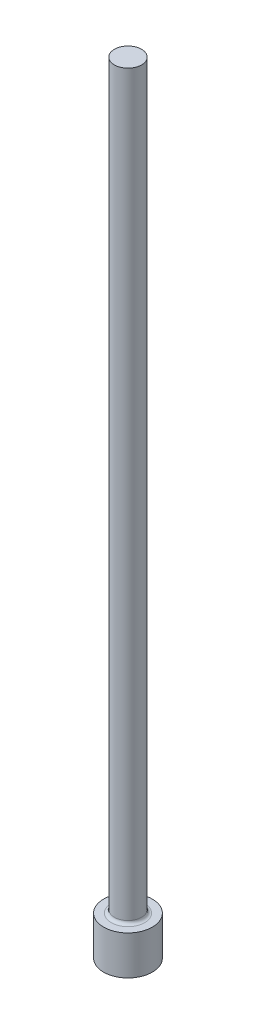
from build123d import *


with BuildPart() as part:
    # Sketch1 → Revolve3 (revolve)
    with BuildSketch(Plane.XY, mode=Mode.PRIVATE) as revolve3_sk:
        with BuildLine():
            Line((0, 0), (1.9812, 0))
            Line((1.9812, 0), (1.9812, 3.175))
            Line((1.9812, 3.175), (1.3589, 3.175))
            ThreePointArc((1.3589, 3.175), (1.179294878, 3.249394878), (1.1049, 3.429))
            Line((1.1049, 3.429), (1.1049, 63.5))
            Line((1.1049, 63.5), (0, 63.5))
            Line((0, 63.5), (0, 0))
        make_face()
    revolve(revolve3_sk.sketch.rotate(Axis((0, 0, 0), (0, -1, 0)), 90), axis=Axis((0, 0, 0), (0, -1, 0)))


solid = part.part
